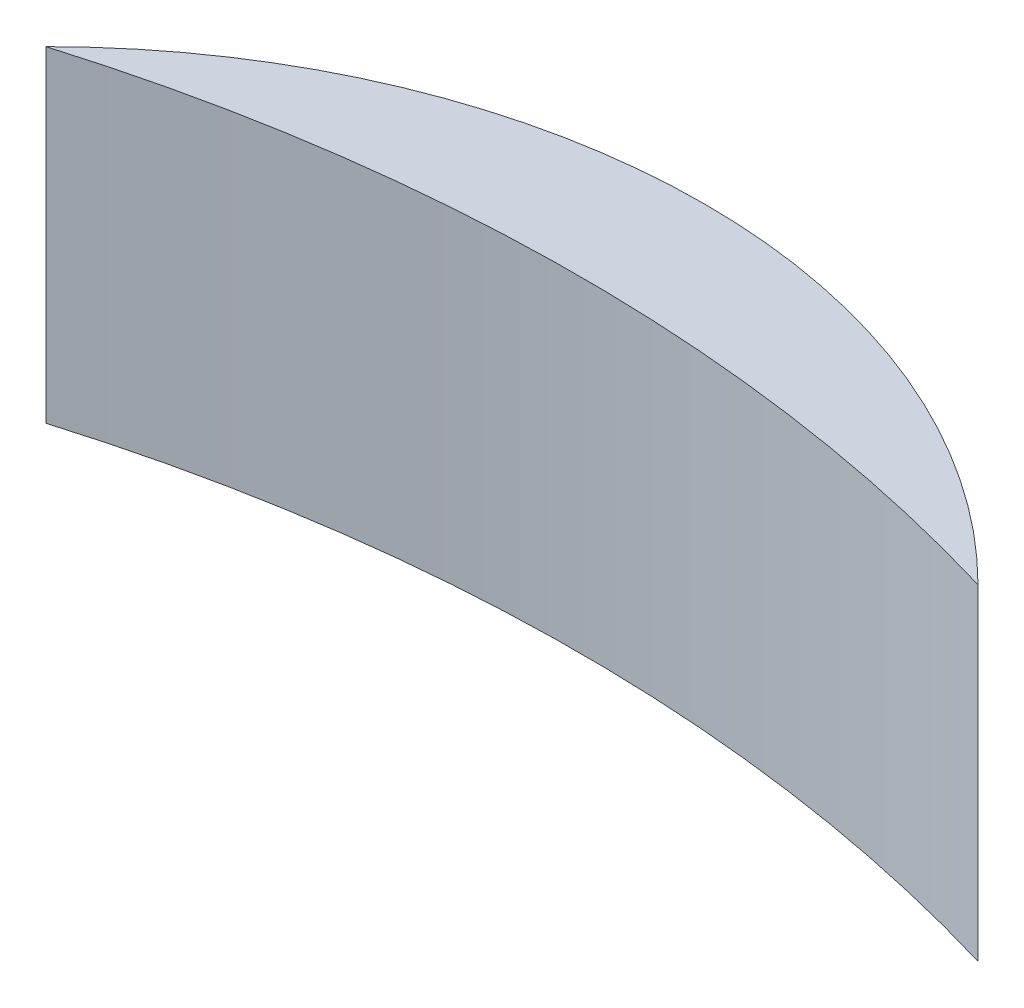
ISO-10303-21;
HEADER;
FILE_DESCRIPTION(('STEP AP214'),'2;1');
FILE_NAME('part.step','',(''),(''),'','','');
FILE_SCHEMA(('AUTOMOTIVE_DESIGN { 1 0 10303 214 1 1 1 1 }'));
ENDSEC;
DATA;
#1=APPLICATION_CONTEXT('core data for automotive mechanical design processes');
#2=APPLICATION_PROTOCOL_DEFINITION('international standard','automotive_design',2000,#1);
#3=PRODUCT_CONTEXT('',#1,'mechanical');
#4=PRODUCT('Part','Part','',(#3));
#5=PRODUCT_RELATED_PRODUCT_CATEGORY('part','',(#4));
#6=PRODUCT_DEFINITION_FORMATION('','',#4);
#7=PRODUCT_DEFINITION_CONTEXT('part definition',#1,'design');
#8=PRODUCT_DEFINITION('design','',#6,#7);
#9=PRODUCT_DEFINITION_SHAPE('','',#8);
#10=(LENGTH_UNIT() NAMED_UNIT(*) SI_UNIT(.MILLI.,.METRE.));
#11=(NAMED_UNIT(*) PLANE_ANGLE_UNIT() SI_UNIT($,.RADIAN.));
#12=(NAMED_UNIT(*) SI_UNIT($,.STERADIAN.) SOLID_ANGLE_UNIT());
#13=UNCERTAINTY_MEASURE_WITH_UNIT(LENGTH_MEASURE(1.E-05),#10,'distance_accuracy_value','');
#14=(GEOMETRIC_REPRESENTATION_CONTEXT(3) GLOBAL_UNCERTAINTY_ASSIGNED_CONTEXT((#13)) GLOBAL_UNIT_ASSIGNED_CONTEXT((#10,
#11,#12)) REPRESENTATION_CONTEXT('',''));
#15=CARTESIAN_POINT('',(0.,0.,0.));
#16=DIRECTION('',(0.,0.,1.));
#17=DIRECTION('',(1.,0.,0.));
#18=AXIS2_PLACEMENT_3D('',#15,#16,#17);
#19=CARTESIAN_POINT('',(0.,17.78,25.4));
#20=DIRECTION('',(0.,-1.,0.));
#21=DIRECTION('',(0.,0.,-1.));
#22=AXIS2_PLACEMENT_3D('',#19,#20,#21);
#23=CYLINDRICAL_SURFACE('',#22,35.9210244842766);
#24=CARTESIAN_POINT('',(0.,0.,25.4));
#25=DIRECTION('',(0.,-1.,0.));
#26=DIRECTION('',(0.,0.,-1.));
#27=AXIS2_PLACEMENT_3D('',#24,#25,#26);
#28=CIRCLE('',#27,35.9210244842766);
#29=CARTESIAN_POINT('',(-25.4,0.,0.));
#30=VERTEX_POINT('',#29);
#31=CARTESIAN_POINT('',(25.4,0.,0.));
#32=VERTEX_POINT('',#31);
#33=EDGE_CURVE('E71',#30,#32,#28,.T.);
#34=ORIENTED_EDGE('',*,*,#33,.F.);
#35=DIRECTION('',(0.,-1.,0.));
#36=VECTOR('',#35,1.);
#37=CARTESIAN_POINT('',(-25.4,17.78,0.));
#38=LINE('',#37,#36);
#39=CARTESIAN_POINT('',(-25.4,17.78,0.));
#40=VERTEX_POINT('',#39);
#41=EDGE_CURVE('E11',#40,#30,#38,.T.);
#42=ORIENTED_EDGE('',*,*,#41,.F.);
#43=CARTESIAN_POINT('',(0.,17.78,25.4));
#44=DIRECTION('',(0.,-1.,0.));
#45=DIRECTION('',(0.,0.,-1.));
#46=AXIS2_PLACEMENT_3D('',#43,#44,#45);
#47=CIRCLE('',#46,35.9210244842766);
#48=CARTESIAN_POINT('',(25.4,17.78,0.));
#49=VERTEX_POINT('',#48);
#50=EDGE_CURVE('E73',#40,#49,#47,.T.);
#51=ORIENTED_EDGE('',*,*,#50,.T.);
#52=DIRECTION('',(0.,-1.,0.));
#53=VECTOR('',#52,1.);
#54=CARTESIAN_POINT('',(25.4,17.78,0.));
#55=LINE('',#54,#53);
#56=EDGE_CURVE('E42',#49,#32,#55,.T.);
#57=ORIENTED_EDGE('',*,*,#56,.T.);
#58=EDGE_LOOP('',(#34,#42,#51,#57));
#59=FACE_BOUND('',#58,.T.);
#60=ADVANCED_FACE('F39',(#59),#23,.T.);
#61=CARTESIAN_POINT('',(0.,17.78,85.194189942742));
#62=DIRECTION('',(0.,-1.,0.));
#63=DIRECTION('',(0.,0.,-1.));
#64=AXIS2_PLACEMENT_3D('',#61,#62,#63);
#65=CYLINDRICAL_SURFACE('',#64,88.9);
#66=CARTESIAN_POINT('',(0.,0.,85.194189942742));
#67=DIRECTION('',(0.,-1.,0.));
#68=DIRECTION('',(0.,0.,-1.));
#69=AXIS2_PLACEMENT_3D('',#66,#67,#68);
#70=CIRCLE('',#69,88.9);
#71=EDGE_CURVE('E65',#30,#32,#70,.T.);
#72=ORIENTED_EDGE('',*,*,#71,.T.);
#73=ORIENTED_EDGE('',*,*,#56,.F.);
#74=CARTESIAN_POINT('',(0.,17.78,85.194189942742));
#75=DIRECTION('',(0.,-1.,0.));
#76=DIRECTION('',(0.,0.,-1.));
#77=AXIS2_PLACEMENT_3D('',#74,#75,#76);
#78=CIRCLE('',#77,88.9);
#79=EDGE_CURVE('E67',#40,#49,#78,.T.);
#80=ORIENTED_EDGE('',*,*,#79,.F.);
#81=ORIENTED_EDGE('',*,*,#41,.T.);
#82=EDGE_LOOP('',(#72,#73,#80,#81));
#83=FACE_BOUND('',#82,.T.);
#84=ADVANCED_FACE('F64',(#83),#65,.F.);
#85=CARTESIAN_POINT('',(0.,17.78,55.297094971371));
#86=DIRECTION('',(0.,-1.,0.));
#87=DIRECTION('',(0.,0.,-1.));
#88=AXIS2_PLACEMENT_3D('',#85,#86,#87);
#89=PLANE('',#88);
#90=ORIENTED_EDGE('',*,*,#50,.F.);
#91=ORIENTED_EDGE('',*,*,#79,.T.);
#92=EDGE_LOOP('',(#90,#91));
#93=FACE_BOUND('',#92,.T.);
#94=ADVANCED_FACE('F82',(#93),#89,.F.);
#95=CARTESIAN_POINT('',(0.,0.,55.297094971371));
#96=DIRECTION('',(0.,-1.,0.));
#97=DIRECTION('',(0.,0.,-1.));
#98=AXIS2_PLACEMENT_3D('',#95,#96,#97);
#99=PLANE('',#98);
#100=ORIENTED_EDGE('',*,*,#33,.T.);
#101=ORIENTED_EDGE('',*,*,#71,.F.);
#102=EDGE_LOOP('',(#100,#101));
#103=FACE_BOUND('',#102,.T.);
#104=ADVANCED_FACE('F70',(#103),#99,.T.);
#105=CLOSED_SHELL('',(#60,#84,#94,#104));
#106=MANIFOLD_SOLID_BREP('B2',#105);
#107=ADVANCED_BREP_SHAPE_REPRESENTATION('',(#18,#106),#14);
#108=SHAPE_DEFINITION_REPRESENTATION(#9,#107);
ENDSEC;
END-ISO-10303-21;
